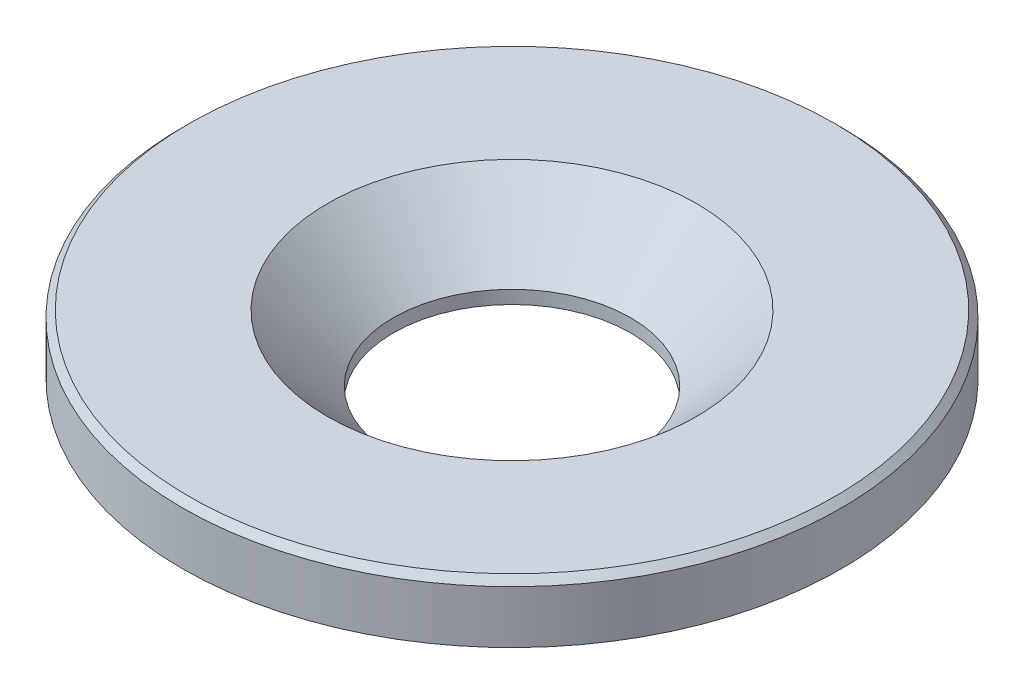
ISO-10303-21;
HEADER;
FILE_DESCRIPTION(('STEP AP214'),'2;1');
FILE_NAME('part.step','',(''),(''),'','','');
FILE_SCHEMA(('AUTOMOTIVE_DESIGN { 1 0 10303 214 1 1 1 1 }'));
ENDSEC;
DATA;
#1=APPLICATION_CONTEXT('core data for automotive mechanical design processes');
#2=APPLICATION_PROTOCOL_DEFINITION('international standard','automotive_design',2000,#1);
#3=PRODUCT_CONTEXT('',#1,'mechanical');
#4=PRODUCT('Part','Part','',(#3));
#5=PRODUCT_RELATED_PRODUCT_CATEGORY('part','',(#4));
#6=PRODUCT_DEFINITION_FORMATION('','',#4);
#7=PRODUCT_DEFINITION_CONTEXT('part definition',#1,'design');
#8=PRODUCT_DEFINITION('design','',#6,#7);
#9=PRODUCT_DEFINITION_SHAPE('','',#8);
#10=(LENGTH_UNIT() NAMED_UNIT(*) SI_UNIT(.MILLI.,.METRE.));
#11=(NAMED_UNIT(*) PLANE_ANGLE_UNIT() SI_UNIT($,.RADIAN.));
#12=(NAMED_UNIT(*) SI_UNIT($,.STERADIAN.) SOLID_ANGLE_UNIT());
#13=UNCERTAINTY_MEASURE_WITH_UNIT(LENGTH_MEASURE(1.E-05),#10,'distance_accuracy_value','');
#14=(GEOMETRIC_REPRESENTATION_CONTEXT(3) GLOBAL_UNCERTAINTY_ASSIGNED_CONTEXT((#13)) GLOBAL_UNIT_ASSIGNED_CONTEXT((#10,
#11,#12)) REPRESENTATION_CONTEXT('',''));
#15=CARTESIAN_POINT('',(0.,0.,0.));
#16=DIRECTION('',(0.,0.,1.));
#17=DIRECTION('',(1.,0.,0.));
#18=AXIS2_PLACEMENT_3D('',#15,#16,#17);
#19=CARTESIAN_POINT('',(0.,0.,0.));
#20=DIRECTION('',(0.,-1.,0.));
#21=DIRECTION('',(0.,0.,-1.));
#22=AXIS2_PLACEMENT_3D('',#19,#20,#21);
#23=CYLINDRICAL_SURFACE('',#22,18.);
#24=CARTESIAN_POINT('',(0.,2.,0.));
#25=DIRECTION('',(0.,-1.,0.));
#26=DIRECTION('',(0.,0.,-1.));
#27=AXIS2_PLACEMENT_3D('',#24,#25,#26);
#28=CIRCLE('',#27,18.);
#29=CARTESIAN_POINT('',(0.,2.,-18.));
#30=VERTEX_POINT('',#29);
#31=EDGE_CURVE('E33',#30,#30,#28,.T.);
#32=ORIENTED_EDGE('',*,*,#31,.F.);
#33=EDGE_LOOP('',(#32));
#34=FACE_BOUND('',#33,.T.);
#35=CARTESIAN_POINT('',(0.,0.,0.));
#36=DIRECTION('',(0.,-1.,0.));
#37=DIRECTION('',(0.,0.,-1.));
#38=AXIS2_PLACEMENT_3D('',#35,#36,#37);
#39=CIRCLE('',#38,18.);
#40=CARTESIAN_POINT('',(0.,0.,-18.));
#41=VERTEX_POINT('',#40);
#42=EDGE_CURVE('E45',#41,#41,#39,.T.);
#43=ORIENTED_EDGE('',*,*,#42,.T.);
#44=EDGE_LOOP('',(#43));
#45=FACE_BOUND('',#44,.T.);
#46=ADVANCED_FACE('F13',(#34,#45),#23,.F.);
#47=CARTESIAN_POINT('',(0.,2.,0.));
#48=DIRECTION('',(0.,1.,0.));
#49=DIRECTION('',(0.,0.,1.));
#50=AXIS2_PLACEMENT_3D('',#47,#48,#49);
#51=CONICAL_SURFACE('',#50,18.,0.78539816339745);
#52=CARTESIAN_POINT('',(0.,12.,0.));
#53=DIRECTION('',(0.,-1.,0.));
#54=DIRECTION('',(0.,0.,-1.));
#55=AXIS2_PLACEMENT_3D('',#52,#53,#54);
#56=CIRCLE('',#55,28.);
#57=CARTESIAN_POINT('',(0.,12.,-28.));
#58=VERTEX_POINT('',#57);
#59=EDGE_CURVE('E36',#58,#58,#56,.T.);
#60=ORIENTED_EDGE('',*,*,#59,.F.);
#61=EDGE_LOOP('',(#60));
#62=FACE_BOUND('',#61,.T.);
#63=ORIENTED_EDGE('',*,*,#31,.T.);
#64=EDGE_LOOP('',(#63));
#65=FACE_BOUND('',#64,.T.);
#66=ADVANCED_FACE('F67',(#62,#65),#51,.F.);
#67=CARTESIAN_POINT('',(-28.,12.,0.));
#68=DIRECTION('',(0.,-1.,0.));
#69=DIRECTION('',(0.,0.,-1.));
#70=AXIS2_PLACEMENT_3D('',#67,#68,#69);
#71=PLANE('',#70);
#72=CARTESIAN_POINT('',(0.,12.,0.));
#73=DIRECTION('',(0.,-1.,0.));
#74=DIRECTION('',(0.,0.,-1.));
#75=AXIS2_PLACEMENT_3D('',#72,#73,#74);
#76=CIRCLE('',#75,49.);
#77=CARTESIAN_POINT('',(0.,12.,-49.));
#78=VERTEX_POINT('',#77);
#79=EDGE_CURVE('E8',#78,#78,#76,.F.);
#80=ORIENTED_EDGE('',*,*,#79,.T.);
#81=EDGE_LOOP('',(#80));
#82=FACE_BOUND('',#81,.T.);
#83=ORIENTED_EDGE('',*,*,#59,.T.);
#84=EDGE_LOOP('',(#83));
#85=FACE_BOUND('',#84,.T.);
#86=ADVANCED_FACE('F74',(#82,#85),#71,.F.);
#87=CARTESIAN_POINT('',(0.,0.,0.));
#88=DIRECTION('',(0.,-1.,0.));
#89=DIRECTION('',(0.,0.,-1.));
#90=AXIS2_PLACEMENT_3D('',#87,#88,#89);
#91=CYLINDRICAL_SURFACE('',#90,50.);
#92=CARTESIAN_POINT('',(0.,11.,0.));
#93=DIRECTION('',(0.,-1.,0.));
#94=DIRECTION('',(0.,0.,-1.));
#95=AXIS2_PLACEMENT_3D('',#92,#93,#94);
#96=CIRCLE('',#95,50.);
#97=CARTESIAN_POINT('',(0.,11.,-50.));
#98=VERTEX_POINT('',#97);
#99=EDGE_CURVE('E20',#98,#98,#96,.T.);
#100=ORIENTED_EDGE('',*,*,#99,.T.);
#101=EDGE_LOOP('',(#100));
#102=FACE_BOUND('',#101,.T.);
#103=CARTESIAN_POINT('',(0.,3.,0.));
#104=DIRECTION('',(0.,-1.,0.));
#105=DIRECTION('',(0.,0.,-1.));
#106=AXIS2_PLACEMENT_3D('',#103,#104,#105);
#107=CIRCLE('',#106,50.);
#108=CARTESIAN_POINT('',(0.,3.,-50.));
#109=VERTEX_POINT('',#108);
#110=EDGE_CURVE('E39',#109,#109,#107,.T.);
#111=ORIENTED_EDGE('',*,*,#110,.F.);
#112=EDGE_LOOP('',(#111));
#113=FACE_BOUND('',#112,.T.);
#114=ADVANCED_FACE('F81',(#102,#113),#91,.T.);
#115=CARTESIAN_POINT('',(-45.,3.,0.));
#116=DIRECTION('',(0.,1.,0.));
#117=DIRECTION('',(0.,0.,1.));
#118=AXIS2_PLACEMENT_3D('',#115,#116,#117);
#119=PLANE('',#118);
#120=CARTESIAN_POINT('',(0.,3.,0.));
#121=DIRECTION('',(0.,-1.,0.));
#122=DIRECTION('',(0.,0.,-1.));
#123=AXIS2_PLACEMENT_3D('',#120,#121,#122);
#124=CIRCLE('',#123,45.);
#125=CARTESIAN_POINT('',(0.,3.,-45.));
#126=VERTEX_POINT('',#125);
#127=EDGE_CURVE('E42',#126,#126,#124,.T.);
#128=ORIENTED_EDGE('',*,*,#127,.F.);
#129=EDGE_LOOP('',(#128));
#130=FACE_BOUND('',#129,.T.);
#131=ORIENTED_EDGE('',*,*,#110,.T.);
#132=EDGE_LOOP('',(#131));
#133=FACE_BOUND('',#132,.T.);
#134=ADVANCED_FACE('F63',(#130,#133),#119,.F.);
#135=CARTESIAN_POINT('',(0.,0.,0.));
#136=DIRECTION('',(0.,-1.,0.));
#137=DIRECTION('',(0.,0.,-1.));
#138=AXIS2_PLACEMENT_3D('',#135,#136,#137);
#139=CYLINDRICAL_SURFACE('',#138,45.);
#140=CARTESIAN_POINT('',(0.,1.00000000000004,0.));
#141=DIRECTION('',(0.,1.,0.));
#142=DIRECTION('',(0.,0.,1.));
#143=AXIS2_PLACEMENT_3D('',#140,#141,#142);
#144=CIRCLE('',#143,45.);
#145=CARTESIAN_POINT('',(0.,1.00000000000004,45.));
#146=VERTEX_POINT('',#145);
#147=EDGE_CURVE('E24',#146,#146,#144,.T.);
#148=ORIENTED_EDGE('',*,*,#147,.T.);
#149=EDGE_LOOP('',(#148));
#150=FACE_BOUND('',#149,.T.);
#151=ORIENTED_EDGE('',*,*,#127,.T.);
#152=EDGE_LOOP('',(#151));
#153=FACE_BOUND('',#152,.T.);
#154=ADVANCED_FACE('F53',(#150,#153),#139,.T.);
#155=CARTESIAN_POINT('',(-18.,0.,0.));
#156=DIRECTION('',(0.,1.,0.));
#157=DIRECTION('',(0.,0.,1.));
#158=AXIS2_PLACEMENT_3D('',#155,#156,#157);
#159=PLANE('',#158);
#160=CARTESIAN_POINT('',(0.,0.,0.));
#161=DIRECTION('',(0.,1.,0.));
#162=DIRECTION('',(0.,0.,1.));
#163=AXIS2_PLACEMENT_3D('',#160,#161,#162);
#164=CIRCLE('',#163,44.);
#165=CARTESIAN_POINT('',(0.,0.,44.));
#166=VERTEX_POINT('',#165);
#167=EDGE_CURVE('E28',#166,#166,#164,.F.);
#168=ORIENTED_EDGE('',*,*,#167,.T.);
#169=EDGE_LOOP('',(#168));
#170=FACE_BOUND('',#169,.T.);
#171=ORIENTED_EDGE('',*,*,#42,.F.);
#172=EDGE_LOOP('',(#171));
#173=FACE_BOUND('',#172,.T.);
#174=ADVANCED_FACE('F50',(#170,#173),#159,.F.);
#175=CARTESIAN_POINT('',(0.,0.,0.));
#176=DIRECTION('',(0.,1.,0.));
#177=DIRECTION('',(0.,0.,1.));
#178=AXIS2_PLACEMENT_3D('',#175,#176,#177);
#179=CONICAL_SURFACE('',#178,44.,0.785398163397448);
#180=ORIENTED_EDGE('',*,*,#147,.F.);
#181=EDGE_LOOP('',(#180));
#182=FACE_BOUND('',#181,.T.);
#183=ORIENTED_EDGE('',*,*,#167,.F.);
#184=EDGE_LOOP('',(#183));
#185=FACE_BOUND('',#184,.T.);
#186=ADVANCED_FACE('F52',(#182,#185),#179,.T.);
#187=CARTESIAN_POINT('',(0.,11.,0.));
#188=DIRECTION('',(0.,-1.,0.));
#189=DIRECTION('',(0.,0.,-1.));
#190=AXIS2_PLACEMENT_3D('',#187,#188,#189);
#191=CONICAL_SURFACE('',#190,50.,0.785398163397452);
#192=ORIENTED_EDGE('',*,*,#79,.F.);
#193=EDGE_LOOP('',(#192));
#194=FACE_BOUND('',#193,.T.);
#195=ORIENTED_EDGE('',*,*,#99,.F.);
#196=EDGE_LOOP('',(#195));
#197=FACE_BOUND('',#196,.T.);
#198=ADVANCED_FACE('F15',(#194,#197),#191,.T.);
#199=CLOSED_SHELL('',(#46,#66,#86,#114,#134,#154,#174,#186,#198));
#200=MANIFOLD_SOLID_BREP('B1',#199);
#201=ADVANCED_BREP_SHAPE_REPRESENTATION('',(#18,#200),#14);
#202=SHAPE_DEFINITION_REPRESENTATION(#9,#201);
ENDSEC;
END-ISO-10303-21;
